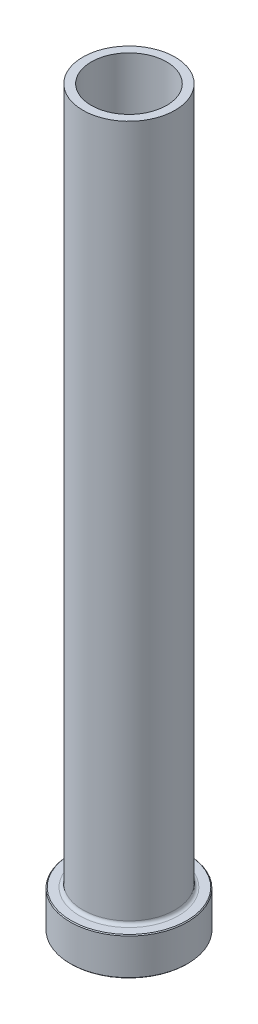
ISO-10303-21;
HEADER;
FILE_DESCRIPTION(('STEP AP214'),'2;1');
FILE_NAME('part.step','',(''),(''),'','','');
FILE_SCHEMA(('AUTOMOTIVE_DESIGN { 1 0 10303 214 1 1 1 1 }'));
ENDSEC;
DATA;
#1=APPLICATION_CONTEXT('core data for automotive mechanical design processes');
#2=APPLICATION_PROTOCOL_DEFINITION('international standard','automotive_design',2000,#1);
#3=PRODUCT_CONTEXT('',#1,'mechanical');
#4=PRODUCT('Part','Part','',(#3));
#5=PRODUCT_RELATED_PRODUCT_CATEGORY('part','',(#4));
#6=PRODUCT_DEFINITION_FORMATION('','',#4);
#7=PRODUCT_DEFINITION_CONTEXT('part definition',#1,'design');
#8=PRODUCT_DEFINITION('design','',#6,#7);
#9=PRODUCT_DEFINITION_SHAPE('','',#8);
#10=(LENGTH_UNIT() NAMED_UNIT(*) SI_UNIT(.MILLI.,.METRE.));
#11=(NAMED_UNIT(*) PLANE_ANGLE_UNIT() SI_UNIT($,.RADIAN.));
#12=(NAMED_UNIT(*) SI_UNIT($,.STERADIAN.) SOLID_ANGLE_UNIT());
#13=UNCERTAINTY_MEASURE_WITH_UNIT(LENGTH_MEASURE(1.E-05),#10,'distance_accuracy_value','');
#14=(GEOMETRIC_REPRESENTATION_CONTEXT(3) GLOBAL_UNCERTAINTY_ASSIGNED_CONTEXT((#13)) GLOBAL_UNIT_ASSIGNED_CONTEXT((#10,
#11,#12)) REPRESENTATION_CONTEXT('',''));
#15=CARTESIAN_POINT('',(0.,0.,0.));
#16=DIRECTION('',(0.,0.,1.));
#17=DIRECTION('',(1.,0.,0.));
#18=AXIS2_PLACEMENT_3D('',#15,#16,#17);
#19=CARTESIAN_POINT('',(0.,92.1876809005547,0.));
#20=DIRECTION('',(0.,1.,0.));
#21=DIRECTION('',(0.,0.,1.));
#22=AXIS2_PLACEMENT_3D('',#19,#20,#21);
#23=CYLINDRICAL_SURFACE('',#22,9.);
#24=CARTESIAN_POINT('',(0.,175.,0.));
#25=DIRECTION('',(0.,1.,0.));
#26=DIRECTION('',(0.,0.,1.));
#27=AXIS2_PLACEMENT_3D('',#24,#25,#26);
#28=CIRCLE('',#27,9.);
#29=CARTESIAN_POINT('',(0.,175.,9.));
#30=VERTEX_POINT('',#29);
#31=EDGE_CURVE('E62',#30,#30,#28,.T.);
#32=ORIENTED_EDGE('',*,*,#31,.T.);
#33=EDGE_LOOP('',(#32));
#34=FACE_BOUND('',#33,.T.);
#35=CARTESIAN_POINT('',(0.,120.,0.));
#36=DIRECTION('',(0.,1.,0.));
#37=DIRECTION('',(0.,0.,1.));
#38=AXIS2_PLACEMENT_3D('',#35,#36,#37);
#39=CIRCLE('',#38,9.);
#40=CARTESIAN_POINT('',(0.,120.,9.));
#41=VERTEX_POINT('',#40);
#42=EDGE_CURVE('E71',#41,#41,#39,.T.);
#43=ORIENTED_EDGE('',*,*,#42,.F.);
#44=EDGE_LOOP('',(#43));
#45=FACE_BOUND('',#44,.T.);
#46=ADVANCED_FACE('F30',(#34,#45),#23,.F.);
#47=CARTESIAN_POINT('',(-9.,175.,0.));
#48=DIRECTION('',(0.,1.,0.));
#49=DIRECTION('',(0.,0.,1.));
#50=AXIS2_PLACEMENT_3D('',#47,#48,#49);
#51=PLANE('',#50);
#52=CARTESIAN_POINT('',(0.,175.,0.));
#53=DIRECTION('',(0.,1.,0.));
#54=DIRECTION('',(0.,0.,1.));
#55=AXIS2_PLACEMENT_3D('',#52,#53,#54);
#56=CIRCLE('',#55,11.);
#57=CARTESIAN_POINT('',(0.,175.,11.));
#58=VERTEX_POINT('',#57);
#59=EDGE_CURVE('E65',#58,#58,#56,.T.);
#60=ORIENTED_EDGE('',*,*,#59,.T.);
#61=EDGE_LOOP('',(#60));
#62=FACE_BOUND('',#61,.T.);
#63=ORIENTED_EDGE('',*,*,#31,.F.);
#64=EDGE_LOOP('',(#63));
#65=FACE_BOUND('',#64,.T.);
#66=ADVANCED_FACE('F79',(#62,#65),#51,.T.);
#67=CARTESIAN_POINT('',(0.,92.1876809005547,0.));
#68=DIRECTION('',(0.,1.,0.));
#69=DIRECTION('',(0.,0.,1.));
#70=AXIS2_PLACEMENT_3D('',#67,#68,#69);
#71=CYLINDRICAL_SURFACE('',#70,11.);
#72=CARTESIAN_POINT('',(0.,9.8,0.));
#73=DIRECTION('',(0.,1.,0.));
#74=DIRECTION('',(0.,0.,1.));
#75=AXIS2_PLACEMENT_3D('',#72,#73,#74);
#76=CIRCLE('',#75,11.);
#77=CARTESIAN_POINT('',(0.,9.8,11.));
#78=VERTEX_POINT('',#77);
#79=EDGE_CURVE('E59',#78,#78,#76,.T.);
#80=ORIENTED_EDGE('',*,*,#79,.T.);
#81=EDGE_LOOP('',(#80));
#82=FACE_BOUND('',#81,.T.);
#83=ORIENTED_EDGE('',*,*,#59,.F.);
#84=EDGE_LOOP('',(#83));
#85=FACE_BOUND('',#84,.T.);
#86=ADVANCED_FACE('F85',(#82,#85),#71,.T.);
#87=CARTESIAN_POINT('',(-11.,9.,0.));
#88=DIRECTION('',(0.,1.,0.));
#89=DIRECTION('',(0.,0.,1.));
#90=AXIS2_PLACEMENT_3D('',#87,#88,#89);
#91=PLANE('',#90);
#92=CARTESIAN_POINT('',(0.,9.,0.));
#93=DIRECTION('',(0.,1.,0.));
#94=DIRECTION('',(0.,0.,1.));
#95=AXIS2_PLACEMENT_3D('',#92,#93,#94);
#96=CIRCLE('',#95,13.8);
#97=CARTESIAN_POINT('',(0.,9.,13.8));
#98=VERTEX_POINT('',#97);
#99=EDGE_CURVE('E53',#98,#98,#96,.T.);
#100=ORIENTED_EDGE('',*,*,#99,.T.);
#101=EDGE_LOOP('',(#100));
#102=FACE_BOUND('',#101,.T.);
#103=CARTESIAN_POINT('',(0.,9.,0.));
#104=DIRECTION('',(0.,1.,0.));
#105=DIRECTION('',(0.,0.,1.));
#106=AXIS2_PLACEMENT_3D('',#103,#104,#105);
#107=CIRCLE('',#106,11.8);
#108=CARTESIAN_POINT('',(0.,9.,11.8));
#109=VERTEX_POINT('',#108);
#110=EDGE_CURVE('E56',#109,#109,#107,.F.);
#111=ORIENTED_EDGE('',*,*,#110,.T.);
#112=EDGE_LOOP('',(#111));
#113=FACE_BOUND('',#112,.T.);
#114=ADVANCED_FACE('F111',(#102,#113),#91,.T.);
#115=CARTESIAN_POINT('',(0.,92.1876809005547,0.));
#116=DIRECTION('',(0.,1.,0.));
#117=DIRECTION('',(0.,0.,1.));
#118=AXIS2_PLACEMENT_3D('',#115,#116,#117);
#119=CYLINDRICAL_SURFACE('',#118,14.);
#120=CARTESIAN_POINT('',(0.,8.8,0.));
#121=DIRECTION('',(0.,1.,0.));
#122=DIRECTION('',(0.,0.,1.));
#123=AXIS2_PLACEMENT_3D('',#120,#121,#122);
#124=CIRCLE('',#123,14.);
#125=CARTESIAN_POINT('',(0.,8.8,14.));
#126=VERTEX_POINT('',#125);
#127=EDGE_CURVE('E45',#126,#126,#124,.F.);
#128=ORIENTED_EDGE('',*,*,#127,.T.);
#129=EDGE_LOOP('',(#128));
#130=FACE_BOUND('',#129,.T.);
#131=CARTESIAN_POINT('',(0.,0.200000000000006,0.));
#132=DIRECTION('',(0.,-1.,0.));
#133=DIRECTION('',(0.,0.,-1.));
#134=AXIS2_PLACEMENT_3D('',#131,#132,#133);
#135=CIRCLE('',#134,14.);
#136=CARTESIAN_POINT('',(0.,0.200000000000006,-14.));
#137=VERTEX_POINT('',#136);
#138=EDGE_CURVE('E50',#137,#137,#135,.F.);
#139=ORIENTED_EDGE('',*,*,#138,.T.);
#140=EDGE_LOOP('',(#139));
#141=FACE_BOUND('',#140,.T.);
#142=ADVANCED_FACE('F108',(#130,#141),#119,.T.);
#143=CARTESIAN_POINT('',(-14.,0.,0.));
#144=DIRECTION('',(0.,-1.,0.));
#145=DIRECTION('',(0.,0.,-1.));
#146=AXIS2_PLACEMENT_3D('',#143,#144,#145);
#147=PLANE('',#146);
#148=CARTESIAN_POINT('',(0.,0.,0.));
#149=DIRECTION('',(0.,-1.,0.));
#150=DIRECTION('',(0.,0.,-1.));
#151=AXIS2_PLACEMENT_3D('',#148,#149,#150);
#152=CIRCLE('',#151,9.74999999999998);
#153=CARTESIAN_POINT('',(0.,0.,-9.74999999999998));
#154=VERTEX_POINT('',#153);
#155=EDGE_CURVE('E37',#154,#154,#152,.F.);
#156=ORIENTED_EDGE('',*,*,#155,.T.);
#157=EDGE_LOOP('',(#156));
#158=FACE_BOUND('',#157,.T.);
#159=CARTESIAN_POINT('',(0.,0.,0.));
#160=DIRECTION('',(0.,-1.,0.));
#161=DIRECTION('',(0.,0.,-1.));
#162=AXIS2_PLACEMENT_3D('',#159,#160,#161);
#163=CIRCLE('',#162,13.8);
#164=CARTESIAN_POINT('',(0.,0.,-13.8));
#165=VERTEX_POINT('',#164);
#166=EDGE_CURVE('E41',#165,#165,#163,.T.);
#167=ORIENTED_EDGE('',*,*,#166,.T.);
#168=EDGE_LOOP('',(#167));
#169=FACE_BOUND('',#168,.T.);
#170=ADVANCED_FACE('F110',(#158,#169),#147,.T.);
#171=CARTESIAN_POINT('',(0.,92.1876809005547,0.));
#172=DIRECTION('',(0.,1.,0.));
#173=DIRECTION('',(0.,0.,1.));
#174=AXIS2_PLACEMENT_3D('',#171,#172,#173);
#175=CYLINDRICAL_SURFACE('',#174,9.25);
#176=CARTESIAN_POINT('',(0.,0.5,0.));
#177=DIRECTION('',(0.,-1.,0.));
#178=DIRECTION('',(0.,0.,-1.));
#179=AXIS2_PLACEMENT_3D('',#176,#177,#178);
#180=CIRCLE('',#179,9.25);
#181=CARTESIAN_POINT('',(0.,0.5,-9.25));
#182=VERTEX_POINT('',#181);
#183=EDGE_CURVE('E10',#182,#182,#180,.T.);
#184=ORIENTED_EDGE('',*,*,#183,.T.);
#185=EDGE_LOOP('',(#184));
#186=FACE_BOUND('',#185,.T.);
#187=CARTESIAN_POINT('',(0.,108.,0.));
#188=DIRECTION('',(0.,1.,0.));
#189=DIRECTION('',(0.,0.,1.));
#190=AXIS2_PLACEMENT_3D('',#187,#188,#189);
#191=CIRCLE('',#190,9.25);
#192=CARTESIAN_POINT('',(0.,108.,9.25));
#193=VERTEX_POINT('',#192);
#194=EDGE_CURVE('E68',#193,#193,#191,.T.);
#195=ORIENTED_EDGE('',*,*,#194,.T.);
#196=EDGE_LOOP('',(#195));
#197=FACE_BOUND('',#196,.T.);
#198=ADVANCED_FACE('F118',(#186,#197),#175,.F.);
#199=CARTESIAN_POINT('',(0.,108.,0.));
#200=DIRECTION('',(0.,-1.,0.));
#201=DIRECTION('',(0.,0.,-1.));
#202=AXIS2_PLACEMENT_3D('',#199,#200,#201);
#203=CONICAL_SURFACE('',#202,9.25,0.0208303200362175);
#204=ORIENTED_EDGE('',*,*,#42,.T.);
#205=EDGE_LOOP('',(#204));
#206=FACE_BOUND('',#205,.T.);
#207=ORIENTED_EDGE('',*,*,#194,.F.);
#208=EDGE_LOOP('',(#207));
#209=FACE_BOUND('',#208,.T.);
#210=ADVANCED_FACE('F75',(#206,#209),#203,.F.);
#211=CARTESIAN_POINT('',(0.,9.8,0.));
#212=DIRECTION('',(0.,1.,0.));
#213=DIRECTION('',(0.,0.,1.));
#214=AXIS2_PLACEMENT_3D('',#211,#212,#213);
#215=TOROIDAL_SURFACE('',#214,11.8,0.8);
#216=ORIENTED_EDGE('',*,*,#110,.F.);
#217=EDGE_LOOP('',(#216));
#218=FACE_BOUND('',#217,.T.);
#219=ORIENTED_EDGE('',*,*,#79,.F.);
#220=EDGE_LOOP('',(#219));
#221=FACE_BOUND('',#220,.T.);
#222=ADVANCED_FACE('F90',(#218,#221),#215,.F.);
#223=CARTESIAN_POINT('',(0.,8.99999999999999,0.));
#224=DIRECTION('',(0.,-1.,0.));
#225=DIRECTION('',(0.,0.,-1.));
#226=AXIS2_PLACEMENT_3D('',#223,#224,#225);
#227=CONICAL_SURFACE('',#226,13.8,0.785398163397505);
#228=ORIENTED_EDGE('',*,*,#127,.F.);
#229=EDGE_LOOP('',(#228));
#230=FACE_BOUND('',#229,.T.);
#231=ORIENTED_EDGE('',*,*,#99,.F.);
#232=EDGE_LOOP('',(#231));
#233=FACE_BOUND('',#232,.T.);
#234=ADVANCED_FACE('F93',(#230,#233),#227,.T.);
#235=CARTESIAN_POINT('',(0.,0.200000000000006,0.));
#236=DIRECTION('',(0.,1.,0.));
#237=DIRECTION('',(0.,0.,1.));
#238=AXIS2_PLACEMENT_3D('',#235,#236,#237);
#239=CONICAL_SURFACE('',#238,14.,0.785398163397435);
#240=ORIENTED_EDGE('',*,*,#166,.F.);
#241=EDGE_LOOP('',(#240));
#242=FACE_BOUND('',#241,.T.);
#243=ORIENTED_EDGE('',*,*,#138,.F.);
#244=EDGE_LOOP('',(#243));
#245=FACE_BOUND('',#244,.T.);
#246=ADVANCED_FACE('F96',(#242,#245),#239,.T.);
#247=CARTESIAN_POINT('',(0.,0.,0.));
#248=DIRECTION('',(0.,-1.,0.));
#249=DIRECTION('',(0.,0.,-1.));
#250=AXIS2_PLACEMENT_3D('',#247,#248,#249);
#251=CONICAL_SURFACE('',#250,9.74999999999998,0.785398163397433);
#252=ORIENTED_EDGE('',*,*,#183,.F.);
#253=EDGE_LOOP('',(#252));
#254=FACE_BOUND('',#253,.T.);
#255=ORIENTED_EDGE('',*,*,#155,.F.);
#256=EDGE_LOOP('',(#255));
#257=FACE_BOUND('',#256,.T.);
#258=ADVANCED_FACE('F32',(#254,#257),#251,.F.);
#259=CLOSED_SHELL('',(#46,#66,#86,#114,#142,#170,#198,#210,#222,#234,#246,#258));
#260=MANIFOLD_SOLID_BREP('B2',#259);
#261=ADVANCED_BREP_SHAPE_REPRESENTATION('',(#18,#260),#14);
#262=SHAPE_DEFINITION_REPRESENTATION(#9,#261);
ENDSEC;
END-ISO-10303-21;
